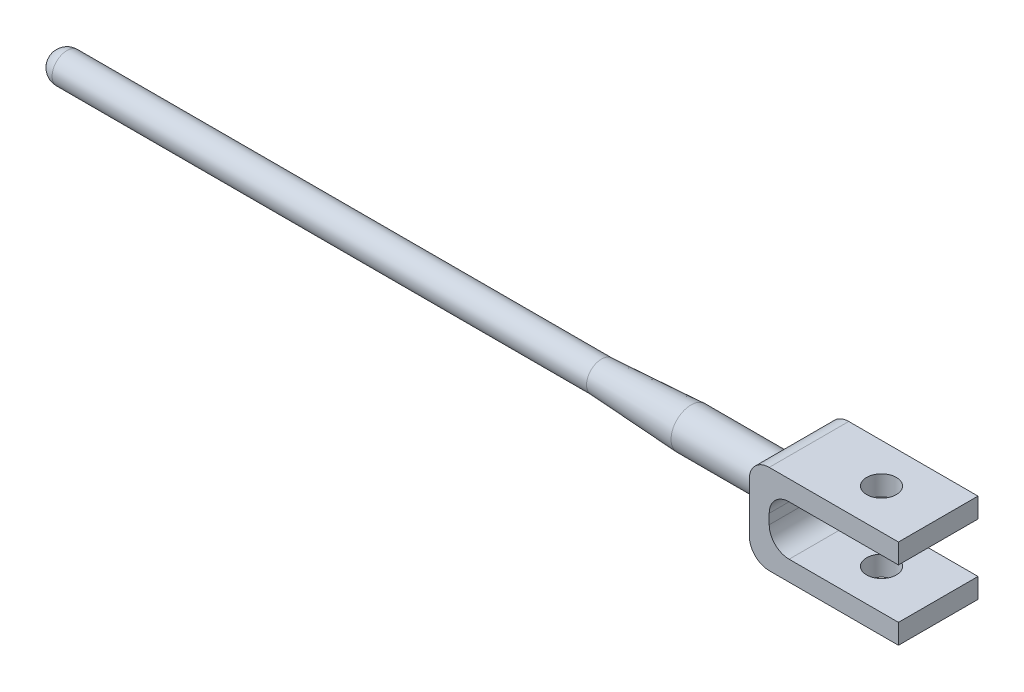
ISO-10303-21;
HEADER;
FILE_DESCRIPTION(('STEP AP214'),'2;1');
FILE_NAME('part.step','',(''),(''),'','','');
FILE_SCHEMA(('AUTOMOTIVE_DESIGN { 1 0 10303 214 1 1 1 1 }'));
ENDSEC;
DATA;
#1=APPLICATION_CONTEXT('core data for automotive mechanical design processes');
#2=APPLICATION_PROTOCOL_DEFINITION('international standard','automotive_design',2000,#1);
#3=PRODUCT_CONTEXT('',#1,'mechanical');
#4=PRODUCT('Part','Part','',(#3));
#5=PRODUCT_RELATED_PRODUCT_CATEGORY('part','',(#4));
#6=PRODUCT_DEFINITION_FORMATION('','',#4);
#7=PRODUCT_DEFINITION_CONTEXT('part definition',#1,'design');
#8=PRODUCT_DEFINITION('design','',#6,#7);
#9=PRODUCT_DEFINITION_SHAPE('','',#8);
#10=(LENGTH_UNIT() NAMED_UNIT(*) SI_UNIT(.MILLI.,.METRE.));
#11=(NAMED_UNIT(*) PLANE_ANGLE_UNIT() SI_UNIT($,.RADIAN.));
#12=(NAMED_UNIT(*) SI_UNIT($,.STERADIAN.) SOLID_ANGLE_UNIT());
#13=UNCERTAINTY_MEASURE_WITH_UNIT(LENGTH_MEASURE(1.E-05),#10,'distance_accuracy_value','');
#14=(GEOMETRIC_REPRESENTATION_CONTEXT(3) GLOBAL_UNCERTAINTY_ASSIGNED_CONTEXT((#13)) GLOBAL_UNIT_ASSIGNED_CONTEXT((#10,
#11,#12)) REPRESENTATION_CONTEXT('',''));
#15=CARTESIAN_POINT('',(0.,0.,0.));
#16=DIRECTION('',(0.,0.,1.));
#17=DIRECTION('',(1.,0.,0.));
#18=AXIS2_PLACEMENT_3D('',#15,#16,#17);
#19=CARTESIAN_POINT('',(-25.8599805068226,2.5,8.));
#20=DIRECTION('',(1.,0.,0.));
#21=DIRECTION('',(0.,0.,-1.));
#22=AXIS2_PLACEMENT_3D('',#19,#20,#21);
#23=PLANE('',#22);
#24=DIRECTION('',(0.,-1.,0.));
#25=VECTOR('',#24,1.);
#26=CARTESIAN_POINT('',(-25.8599805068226,2.5,0.));
#27=LINE('',#26,#25);
#28=CARTESIAN_POINT('',(-25.8599805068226,2.5,0.));
#29=VERTEX_POINT('',#28);
#30=CARTESIAN_POINT('',(-25.8599805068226,-2.5,0.));
#31=VERTEX_POINT('',#30);
#32=EDGE_CURVE('E161',#29,#31,#27,.T.);
#33=ORIENTED_EDGE('',*,*,#32,.T.);
#34=DIRECTION('',(0.,0.,-1.));
#35=VECTOR('',#34,1.);
#36=CARTESIAN_POINT('',(-25.8599805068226,-2.5,8.));
#37=LINE('',#36,#35);
#38=CARTESIAN_POINT('',(-25.8599805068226,-2.5,8.));
#39=VERTEX_POINT('',#38);
#40=EDGE_CURVE('E192',#39,#31,#37,.T.);
#41=ORIENTED_EDGE('',*,*,#40,.F.);
#42=DIRECTION('',(0.,-1.,0.));
#43=VECTOR('',#42,1.);
#44=CARTESIAN_POINT('',(-25.8599805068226,2.5,8.));
#45=LINE('',#44,#43);
#46=CARTESIAN_POINT('',(-25.8599805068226,2.5,8.));
#47=VERTEX_POINT('',#46);
#48=EDGE_CURVE('E223',#47,#39,#45,.T.);
#49=ORIENTED_EDGE('',*,*,#48,.F.);
#50=DIRECTION('',(0.,0.,-1.));
#51=VECTOR('',#50,1.);
#52=CARTESIAN_POINT('',(-25.8599805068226,2.5,8.));
#53=LINE('',#52,#51);
#54=EDGE_CURVE('E195',#47,#29,#53,.T.);
#55=ORIENTED_EDGE('',*,*,#54,.T.);
#56=EDGE_LOOP('',(#33,#41,#49,#55));
#57=FACE_BOUND('',#56,.T.);
#58=CARTESIAN_POINT('',(-25.8599805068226,0.,3.99950536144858));
#59=DIRECTION('',(1.,0.,0.));
#60=DIRECTION('',(0.,0.,-1.));
#61=AXIS2_PLACEMENT_3D('',#58,#59,#60);
#62=CIRCLE('',#61,1.99950536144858);
#63=CARTESIAN_POINT('',(-25.8599805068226,0.,2.));
#64=VERTEX_POINT('',#63);
#65=EDGE_CURVE('E11',#64,#64,#62,.F.);
#66=ORIENTED_EDGE('',*,*,#65,.F.);
#67=EDGE_LOOP('',(#66));
#68=FACE_BOUND('',#67,.T.);
#69=ADVANCED_FACE('F31',(#57,#68),#23,.F.);
#70=CARTESIAN_POINT('',(-10.8599805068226,2.5,8.));
#71=DIRECTION('',(-1.,0.,0.));
#72=DIRECTION('',(0.,-1.,0.));
#73=AXIS2_PLACEMENT_3D('',#70,#71,#72);
#74=PLANE('',#73);
#75=DIRECTION('',(0.,1.,0.));
#76=VECTOR('',#75,1.);
#77=CARTESIAN_POINT('',(-10.8599805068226,2.5,0.));
#78=LINE('',#77,#76);
#79=CARTESIAN_POINT('',(-10.8599805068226,2.5,0.));
#80=VERTEX_POINT('',#79);
#81=CARTESIAN_POINT('',(-10.8599805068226,4.5,0.));
#82=VERTEX_POINT('',#81);
#83=EDGE_CURVE('E153',#80,#82,#78,.T.);
#84=ORIENTED_EDGE('',*,*,#83,.T.);
#85=DIRECTION('',(0.,0.,-1.));
#86=VECTOR('',#85,1.);
#87=CARTESIAN_POINT('',(-10.8599805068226,4.5,8.));
#88=LINE('',#87,#86);
#89=CARTESIAN_POINT('',(-10.8599805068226,4.5,8.));
#90=VERTEX_POINT('',#89);
#91=EDGE_CURVE('E40',#90,#82,#88,.T.);
#92=ORIENTED_EDGE('',*,*,#91,.F.);
#93=DIRECTION('',(0.,1.,0.));
#94=VECTOR('',#93,1.);
#95=CARTESIAN_POINT('',(-10.8599805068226,2.5,8.));
#96=LINE('',#95,#94);
#97=CARTESIAN_POINT('',(-10.8599805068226,2.5,8.));
#98=VERTEX_POINT('',#97);
#99=EDGE_CURVE('E176',#98,#90,#96,.T.);
#100=ORIENTED_EDGE('',*,*,#99,.F.);
#101=DIRECTION('',(0.,0.,-1.));
#102=VECTOR('',#101,1.);
#103=CARTESIAN_POINT('',(-10.8599805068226,2.5,8.));
#104=LINE('',#103,#102);
#105=EDGE_CURVE('E149',#98,#80,#104,.T.);
#106=ORIENTED_EDGE('',*,*,#105,.T.);
#107=EDGE_LOOP('',(#84,#92,#100,#106));
#108=FACE_BOUND('',#107,.T.);
#109=ADVANCED_FACE('F33',(#108),#74,.F.);
#110=CARTESIAN_POINT('',(-10.8599805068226,4.5,8.));
#111=DIRECTION('',(0.,-1.,0.));
#112=DIRECTION('',(1.,0.,0.));
#113=AXIS2_PLACEMENT_3D('',#110,#111,#112);
#114=PLANE('',#113);
#115=CARTESIAN_POINT('',(-16.5925733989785,4.49999999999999,3.9745154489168));
#116=DIRECTION('',(0.,1.,0.));
#117=DIRECTION('',(-1.,0.,0.));
#118=AXIS2_PLACEMENT_3D('',#115,#116,#117);
#119=CIRCLE('',#118,1.5);
#120=CARTESIAN_POINT('',(-18.0925733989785,4.49999999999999,3.9745154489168));
#121=VERTEX_POINT('',#120);
#122=EDGE_CURVE('E209',#121,#121,#119,.T.);
#123=ORIENTED_EDGE('',*,*,#122,.F.);
#124=EDGE_LOOP('',(#123));
#125=FACE_BOUND('',#124,.T.);
#126=DIRECTION('',(-1.,0.,0.));
#127=VECTOR('',#126,1.);
#128=CARTESIAN_POINT('',(-10.8599805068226,4.5,0.));
#129=LINE('',#128,#127);
#130=CARTESIAN_POINT('',(-23.8599805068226,4.5,0.));
#131=VERTEX_POINT('',#130);
#132=EDGE_CURVE('E156',#82,#131,#129,.T.);
#133=ORIENTED_EDGE('',*,*,#132,.T.);
#134=DIRECTION('',(0.,0.,-1.));
#135=VECTOR('',#134,1.);
#136=CARTESIAN_POINT('',(-23.8599805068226,4.5,8.));
#137=LINE('',#136,#135);
#138=CARTESIAN_POINT('',(-23.8599805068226,4.5,8.));
#139=VERTEX_POINT('',#138);
#140=EDGE_CURVE('E198',#139,#131,#137,.T.);
#141=ORIENTED_EDGE('',*,*,#140,.F.);
#142=DIRECTION('',(-1.,0.,0.));
#143=VECTOR('',#142,1.);
#144=CARTESIAN_POINT('',(-10.8599805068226,4.5,8.));
#145=LINE('',#144,#143);
#146=EDGE_CURVE('E104',#90,#139,#145,.T.);
#147=ORIENTED_EDGE('',*,*,#146,.F.);
#148=ORIENTED_EDGE('',*,*,#91,.T.);
#149=EDGE_LOOP('',(#133,#141,#147,#148));
#150=FACE_BOUND('',#149,.T.);
#151=ADVANCED_FACE('F265',(#125,#150),#114,.F.);
#152=CARTESIAN_POINT('',(-23.8599805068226,2.5,8.));
#153=DIRECTION('',(0.,0.,-1.));
#154=DIRECTION('',(-1.,0.,0.));
#155=AXIS2_PLACEMENT_3D('',#152,#153,#154);
#156=CYLINDRICAL_SURFACE('',#155,2.);
#157=CARTESIAN_POINT('',(-23.8599805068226,2.5,0.));
#158=DIRECTION('',(0.,0.,1.));
#159=DIRECTION('',(-1.,0.,0.));
#160=AXIS2_PLACEMENT_3D('',#157,#158,#159);
#161=CIRCLE('',#160,2.);
#162=EDGE_CURVE('E159',#131,#29,#161,.T.);
#163=ORIENTED_EDGE('',*,*,#162,.T.);
#164=ORIENTED_EDGE('',*,*,#54,.F.);
#165=CARTESIAN_POINT('',(-23.8599805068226,2.5,8.));
#166=DIRECTION('',(0.,0.,1.));
#167=DIRECTION('',(-1.,0.,0.));
#168=AXIS2_PLACEMENT_3D('',#165,#166,#167);
#169=CIRCLE('',#168,2.);
#170=EDGE_CURVE('E221',#139,#47,#169,.T.);
#171=ORIENTED_EDGE('',*,*,#170,.F.);
#172=ORIENTED_EDGE('',*,*,#140,.T.);
#173=EDGE_LOOP('',(#163,#164,#171,#172));
#174=FACE_BOUND('',#173,.T.);
#175=ADVANCED_FACE('F271',(#174),#156,.T.);
#176=CARTESIAN_POINT('',(-23.8599805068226,-2.5,8.));
#177=DIRECTION('',(0.,0.,-1.));
#178=DIRECTION('',(-1.,0.,0.));
#179=AXIS2_PLACEMENT_3D('',#176,#177,#178);
#180=CYLINDRICAL_SURFACE('',#179,2.);
#181=CARTESIAN_POINT('',(-23.8599805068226,-2.5,0.));
#182=DIRECTION('',(0.,0.,1.));
#183=DIRECTION('',(-1.,0.,0.));
#184=AXIS2_PLACEMENT_3D('',#181,#182,#183);
#185=CIRCLE('',#184,2.);
#186=CARTESIAN_POINT('',(-23.8599805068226,-4.5,0.));
#187=VERTEX_POINT('',#186);
#188=EDGE_CURVE('E163',#31,#187,#185,.T.);
#189=ORIENTED_EDGE('',*,*,#188,.T.);
#190=DIRECTION('',(0.,0.,-1.));
#191=VECTOR('',#190,1.);
#192=CARTESIAN_POINT('',(-23.8599805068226,-4.5,8.));
#193=LINE('',#192,#191);
#194=CARTESIAN_POINT('',(-23.8599805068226,-4.5,8.));
#195=VERTEX_POINT('',#194);
#196=EDGE_CURVE('E189',#195,#187,#193,.T.);
#197=ORIENTED_EDGE('',*,*,#196,.F.);
#198=CARTESIAN_POINT('',(-23.8599805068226,-2.5,8.));
#199=DIRECTION('',(0.,0.,1.));
#200=DIRECTION('',(-1.,0.,0.));
#201=AXIS2_PLACEMENT_3D('',#198,#199,#200);
#202=CIRCLE('',#201,2.);
#203=EDGE_CURVE('E225',#39,#195,#202,.T.);
#204=ORIENTED_EDGE('',*,*,#203,.F.);
#205=ORIENTED_EDGE('',*,*,#40,.T.);
#206=EDGE_LOOP('',(#189,#197,#204,#205));
#207=FACE_BOUND('',#206,.T.);
#208=ADVANCED_FACE('F269',(#207),#180,.T.);
#209=CARTESIAN_POINT('',(-23.8599805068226,-4.5,8.));
#210=DIRECTION('',(0.,1.,0.));
#211=DIRECTION('',(-1.,0.,0.));
#212=AXIS2_PLACEMENT_3D('',#209,#210,#211);
#213=PLANE('',#212);
#214=CARTESIAN_POINT('',(-16.5925733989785,-4.5,3.9745154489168));
#215=DIRECTION('',(0.,1.,0.));
#216=DIRECTION('',(-1.,0.,0.));
#217=AXIS2_PLACEMENT_3D('',#214,#215,#216);
#218=CIRCLE('',#217,1.5);
#219=CARTESIAN_POINT('',(-18.0925733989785,-4.5,3.9745154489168));
#220=VERTEX_POINT('',#219);
#221=EDGE_CURVE('E203',#220,#220,#218,.T.);
#222=ORIENTED_EDGE('',*,*,#221,.T.);
#223=EDGE_LOOP('',(#222));
#224=FACE_BOUND('',#223,.T.);
#225=DIRECTION('',(1.,0.,0.));
#226=VECTOR('',#225,1.);
#227=CARTESIAN_POINT('',(-23.8599805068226,-4.5,0.));
#228=LINE('',#227,#226);
#229=CARTESIAN_POINT('',(-10.8599805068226,-4.5,0.));
#230=VERTEX_POINT('',#229);
#231=EDGE_CURVE('E165',#187,#230,#228,.T.);
#232=ORIENTED_EDGE('',*,*,#231,.T.);
#233=DIRECTION('',(0.,0.,-1.));
#234=VECTOR('',#233,1.);
#235=CARTESIAN_POINT('',(-10.8599805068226,-4.5,8.));
#236=LINE('',#235,#234);
#237=CARTESIAN_POINT('',(-10.8599805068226,-4.5,8.));
#238=VERTEX_POINT('',#237);
#239=EDGE_CURVE('E186',#238,#230,#236,.T.);
#240=ORIENTED_EDGE('',*,*,#239,.F.);
#241=DIRECTION('',(1.,0.,0.));
#242=VECTOR('',#241,1.);
#243=CARTESIAN_POINT('',(-23.8599805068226,-4.5,8.));
#244=LINE('',#243,#242);
#245=EDGE_CURVE('E227',#195,#238,#244,.T.);
#246=ORIENTED_EDGE('',*,*,#245,.F.);
#247=ORIENTED_EDGE('',*,*,#196,.T.);
#248=EDGE_LOOP('',(#232,#240,#246,#247));
#249=FACE_BOUND('',#248,.T.);
#250=ADVANCED_FACE('F292',(#224,#249),#213,.F.);
#251=CARTESIAN_POINT('',(-10.8599805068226,-4.5,8.));
#252=DIRECTION('',(-1.,0.,0.));
#253=DIRECTION('',(0.,0.,1.));
#254=AXIS2_PLACEMENT_3D('',#251,#252,#253);
#255=PLANE('',#254);
#256=DIRECTION('',(0.,1.,0.));
#257=VECTOR('',#256,1.);
#258=CARTESIAN_POINT('',(-10.8599805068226,-4.5,0.));
#259=LINE('',#258,#257);
#260=CARTESIAN_POINT('',(-10.8599805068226,-2.5,0.));
#261=VERTEX_POINT('',#260);
#262=EDGE_CURVE('E167',#230,#261,#259,.T.);
#263=ORIENTED_EDGE('',*,*,#262,.T.);
#264=DIRECTION('',(0.,0.,-1.));
#265=VECTOR('',#264,1.);
#266=CARTESIAN_POINT('',(-10.8599805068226,-2.5,8.));
#267=LINE('',#266,#265);
#268=CARTESIAN_POINT('',(-10.8599805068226,-2.5,8.));
#269=VERTEX_POINT('',#268);
#270=EDGE_CURVE('E183',#269,#261,#267,.T.);
#271=ORIENTED_EDGE('',*,*,#270,.F.);
#272=DIRECTION('',(0.,1.,0.));
#273=VECTOR('',#272,1.);
#274=CARTESIAN_POINT('',(-10.8599805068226,-4.5,8.));
#275=LINE('',#274,#273);
#276=EDGE_CURVE('E229',#238,#269,#275,.T.);
#277=ORIENTED_EDGE('',*,*,#276,.F.);
#278=ORIENTED_EDGE('',*,*,#239,.T.);
#279=EDGE_LOOP('',(#263,#271,#277,#278));
#280=FACE_BOUND('',#279,.T.);
#281=ADVANCED_FACE('F295',(#280),#255,.F.);
#282=CARTESIAN_POINT('',(-10.8599805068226,-2.5,8.));
#283=DIRECTION('',(0.,-1.,0.));
#284=DIRECTION('',(1.,0.,0.));
#285=AXIS2_PLACEMENT_3D('',#282,#283,#284);
#286=PLANE('',#285);
#287=CARTESIAN_POINT('',(-16.5925733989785,-2.5,3.9745154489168));
#288=DIRECTION('',(0.,-1.,0.));
#289=DIRECTION('',(1.,0.,0.));
#290=AXIS2_PLACEMENT_3D('',#287,#288,#289);
#291=CIRCLE('',#290,1.5);
#292=CARTESIAN_POINT('',(-15.0925733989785,-2.5,3.9745154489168));
#293=VERTEX_POINT('',#292);
#294=EDGE_CURVE('E157',#293,#293,#291,.T.);
#295=ORIENTED_EDGE('',*,*,#294,.T.);
#296=EDGE_LOOP('',(#295));
#297=FACE_BOUND('',#296,.T.);
#298=DIRECTION('',(-1.,0.,0.));
#299=VECTOR('',#298,1.);
#300=CARTESIAN_POINT('',(-10.8599805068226,-2.5,0.));
#301=LINE('',#300,#299);
#302=CARTESIAN_POINT('',(-21.8599805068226,-2.5,0.));
#303=VERTEX_POINT('',#302);
#304=EDGE_CURVE('E169',#261,#303,#301,.T.);
#305=ORIENTED_EDGE('',*,*,#304,.T.);
#306=DIRECTION('',(0.,0.,-1.));
#307=VECTOR('',#306,1.);
#308=CARTESIAN_POINT('',(-21.8599805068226,-2.5,8.));
#309=LINE('',#308,#307);
#310=CARTESIAN_POINT('',(-21.8599805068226,-2.5,8.));
#311=VERTEX_POINT('',#310);
#312=EDGE_CURVE('E180',#311,#303,#309,.T.);
#313=ORIENTED_EDGE('',*,*,#312,.F.);
#314=DIRECTION('',(-1.,0.,0.));
#315=VECTOR('',#314,1.);
#316=CARTESIAN_POINT('',(-10.8599805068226,-2.5,8.));
#317=LINE('',#316,#315);
#318=EDGE_CURVE('E231',#269,#311,#317,.T.);
#319=ORIENTED_EDGE('',*,*,#318,.F.);
#320=ORIENTED_EDGE('',*,*,#270,.T.);
#321=EDGE_LOOP('',(#305,#313,#319,#320));
#322=FACE_BOUND('',#321,.T.);
#323=ADVANCED_FACE('F237',(#297,#322),#286,.F.);
#324=CARTESIAN_POINT('',(-21.8599805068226,-0.500000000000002,8.));
#325=DIRECTION('',(0.,0.,-1.));
#326=DIRECTION('',(-1.,0.,0.));
#327=AXIS2_PLACEMENT_3D('',#324,#325,#326);
#328=CYLINDRICAL_SURFACE('',#327,2.);
#329=CARTESIAN_POINT('',(-21.8599805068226,-0.500000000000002,0.));
#330=DIRECTION('',(0.,0.,-1.));
#331=DIRECTION('',(-1.,0.,0.));
#332=AXIS2_PLACEMENT_3D('',#329,#330,#331);
#333=CIRCLE('',#332,2.);
#334=CARTESIAN_POINT('',(-23.8599805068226,-0.500000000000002,0.));
#335=VERTEX_POINT('',#334);
#336=EDGE_CURVE('E171',#303,#335,#333,.T.);
#337=ORIENTED_EDGE('',*,*,#336,.T.);
#338=DIRECTION('',(0.,0.,-1.));
#339=VECTOR('',#338,1.);
#340=CARTESIAN_POINT('',(-23.8599805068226,-0.500000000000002,8.));
#341=LINE('',#340,#339);
#342=CARTESIAN_POINT('',(-23.8599805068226,-0.500000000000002,8.));
#343=VERTEX_POINT('',#342);
#344=EDGE_CURVE('E144',#343,#335,#341,.T.);
#345=ORIENTED_EDGE('',*,*,#344,.F.);
#346=CARTESIAN_POINT('',(-21.8599805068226,-0.500000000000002,8.));
#347=DIRECTION('',(0.,0.,-1.));
#348=DIRECTION('',(-1.,0.,0.));
#349=AXIS2_PLACEMENT_3D('',#346,#347,#348);
#350=CIRCLE('',#349,2.);
#351=EDGE_CURVE('E135',#311,#343,#350,.T.);
#352=ORIENTED_EDGE('',*,*,#351,.F.);
#353=ORIENTED_EDGE('',*,*,#312,.T.);
#354=EDGE_LOOP('',(#337,#345,#352,#353));
#355=FACE_BOUND('',#354,.T.);
#356=ADVANCED_FACE('F241',(#355),#328,.F.);
#357=CARTESIAN_POINT('',(-23.8599805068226,-0.500000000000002,8.));
#358=DIRECTION('',(-1.,0.,0.));
#359=DIRECTION('',(0.,0.,1.));
#360=AXIS2_PLACEMENT_3D('',#357,#358,#359);
#361=PLANE('',#360);
#362=DIRECTION('',(0.,1.,0.));
#363=VECTOR('',#362,1.);
#364=CARTESIAN_POINT('',(-23.8599805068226,-0.500000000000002,0.));
#365=LINE('',#364,#363);
#366=CARTESIAN_POINT('',(-23.8599805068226,0.499999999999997,0.));
#367=VERTEX_POINT('',#366);
#368=EDGE_CURVE('E143',#335,#367,#365,.T.);
#369=ORIENTED_EDGE('',*,*,#368,.T.);
#370=DIRECTION('',(0.,0.,-1.));
#371=VECTOR('',#370,1.);
#372=CARTESIAN_POINT('',(-23.8599805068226,0.499999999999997,8.));
#373=LINE('',#372,#371);
#374=CARTESIAN_POINT('',(-23.8599805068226,0.499999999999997,8.));
#375=VERTEX_POINT('',#374);
#376=EDGE_CURVE('E140',#375,#367,#373,.T.);
#377=ORIENTED_EDGE('',*,*,#376,.F.);
#378=DIRECTION('',(0.,1.,0.));
#379=VECTOR('',#378,1.);
#380=CARTESIAN_POINT('',(-23.8599805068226,-0.500000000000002,8.));
#381=LINE('',#380,#379);
#382=EDGE_CURVE('E129',#343,#375,#381,.T.);
#383=ORIENTED_EDGE('',*,*,#382,.F.);
#384=ORIENTED_EDGE('',*,*,#344,.T.);
#385=EDGE_LOOP('',(#369,#377,#383,#384));
#386=FACE_BOUND('',#385,.T.);
#387=ADVANCED_FACE('F141',(#386),#361,.F.);
#388=CARTESIAN_POINT('',(-21.8599805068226,0.499999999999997,8.));
#389=DIRECTION('',(0.,0.,-1.));
#390=DIRECTION('',(-1.,0.,0.));
#391=AXIS2_PLACEMENT_3D('',#388,#389,#390);
#392=CYLINDRICAL_SURFACE('',#391,2.);
#393=CARTESIAN_POINT('',(-21.8599805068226,0.499999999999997,0.));
#394=DIRECTION('',(0.,0.,-1.));
#395=DIRECTION('',(-1.,0.,0.));
#396=AXIS2_PLACEMENT_3D('',#393,#394,#395);
#397=CIRCLE('',#396,2.);
#398=CARTESIAN_POINT('',(-21.8599805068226,2.5,0.));
#399=VERTEX_POINT('',#398);
#400=EDGE_CURVE('E89',#367,#399,#397,.T.);
#401=ORIENTED_EDGE('',*,*,#400,.T.);
#402=DIRECTION('',(0.,0.,-1.));
#403=VECTOR('',#402,1.);
#404=CARTESIAN_POINT('',(-21.8599805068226,2.5,8.));
#405=LINE('',#404,#403);
#406=CARTESIAN_POINT('',(-21.8599805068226,2.5,8.));
#407=VERTEX_POINT('',#406);
#408=EDGE_CURVE('E145',#407,#399,#405,.T.);
#409=ORIENTED_EDGE('',*,*,#408,.F.);
#410=CARTESIAN_POINT('',(-21.8599805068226,0.499999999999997,8.));
#411=DIRECTION('',(0.,0.,-1.));
#412=DIRECTION('',(-1.,0.,0.));
#413=AXIS2_PLACEMENT_3D('',#410,#411,#412);
#414=CIRCLE('',#413,2.);
#415=EDGE_CURVE('E133',#375,#407,#414,.T.);
#416=ORIENTED_EDGE('',*,*,#415,.F.);
#417=ORIENTED_EDGE('',*,*,#376,.T.);
#418=EDGE_LOOP('',(#401,#409,#416,#417));
#419=FACE_BOUND('',#418,.T.);
#420=ADVANCED_FACE('F147',(#419),#392,.F.);
#421=CARTESIAN_POINT('',(-21.8599805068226,2.5,8.));
#422=DIRECTION('',(0.,1.,0.));
#423=DIRECTION('',(0.,0.,1.));
#424=AXIS2_PLACEMENT_3D('',#421,#422,#423);
#425=PLANE('',#424);
#426=CARTESIAN_POINT('',(-16.5925733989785,2.5,3.9745154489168));
#427=DIRECTION('',(0.,1.,0.));
#428=DIRECTION('',(0.,0.,1.));
#429=AXIS2_PLACEMENT_3D('',#426,#427,#428);
#430=CIRCLE('',#429,1.5);
#431=CARTESIAN_POINT('',(-16.5925733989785,2.5,5.47451544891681));
#432=VERTEX_POINT('',#431);
#433=EDGE_CURVE('E201',#432,#432,#430,.T.);
#434=ORIENTED_EDGE('',*,*,#433,.T.);
#435=EDGE_LOOP('',(#434));
#436=FACE_BOUND('',#435,.T.);
#437=DIRECTION('',(1.,0.,0.));
#438=VECTOR('',#437,1.);
#439=CARTESIAN_POINT('',(-21.8599805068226,2.5,0.));
#440=LINE('',#439,#438);
#441=EDGE_CURVE('E95',#399,#80,#440,.T.);
#442=ORIENTED_EDGE('',*,*,#441,.T.);
#443=ORIENTED_EDGE('',*,*,#105,.F.);
#444=DIRECTION('',(1.,0.,0.));
#445=VECTOR('',#444,1.);
#446=CARTESIAN_POINT('',(-21.8599805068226,2.5,8.));
#447=LINE('',#446,#445);
#448=EDGE_CURVE('E48',#407,#98,#447,.T.);
#449=ORIENTED_EDGE('',*,*,#448,.F.);
#450=ORIENTED_EDGE('',*,*,#408,.T.);
#451=EDGE_LOOP('',(#442,#443,#449,#450));
#452=FACE_BOUND('',#451,.T.);
#453=ADVANCED_FACE('F249',(#436,#452),#425,.F.);
#454=CARTESIAN_POINT('',(-23.8599805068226,2.5,8.));
#455=DIRECTION('',(0.,0.,-1.));
#456=DIRECTION('',(-1.,0.,0.));
#457=AXIS2_PLACEMENT_3D('',#454,#455,#456);
#458=PLANE('',#457);
#459=ORIENTED_EDGE('',*,*,#99,.T.);
#460=ORIENTED_EDGE('',*,*,#146,.T.);
#461=ORIENTED_EDGE('',*,*,#170,.T.);
#462=ORIENTED_EDGE('',*,*,#48,.T.);
#463=ORIENTED_EDGE('',*,*,#203,.T.);
#464=ORIENTED_EDGE('',*,*,#245,.T.);
#465=ORIENTED_EDGE('',*,*,#276,.T.);
#466=ORIENTED_EDGE('',*,*,#318,.T.);
#467=ORIENTED_EDGE('',*,*,#351,.T.);
#468=ORIENTED_EDGE('',*,*,#382,.T.);
#469=ORIENTED_EDGE('',*,*,#415,.T.);
#470=ORIENTED_EDGE('',*,*,#448,.T.);
#471=EDGE_LOOP('',(#459,#460,#461,#462,#463,#464,#465,#466,#467,#468,#469,#470));
#472=FACE_BOUND('',#471,.T.);
#473=ADVANCED_FACE('F131',(#472),#458,.F.);
#474=CARTESIAN_POINT('',(-23.8599805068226,2.5,0.));
#475=DIRECTION('',(0.,0.,-1.));
#476=DIRECTION('',(-1.,0.,0.));
#477=AXIS2_PLACEMENT_3D('',#474,#475,#476);
#478=PLANE('',#477);
#479=ORIENTED_EDGE('',*,*,#83,.F.);
#480=ORIENTED_EDGE('',*,*,#441,.F.);
#481=ORIENTED_EDGE('',*,*,#400,.F.);
#482=ORIENTED_EDGE('',*,*,#368,.F.);
#483=ORIENTED_EDGE('',*,*,#336,.F.);
#484=ORIENTED_EDGE('',*,*,#304,.F.);
#485=ORIENTED_EDGE('',*,*,#262,.F.);
#486=ORIENTED_EDGE('',*,*,#231,.F.);
#487=ORIENTED_EDGE('',*,*,#188,.F.);
#488=ORIENTED_EDGE('',*,*,#32,.F.);
#489=ORIENTED_EDGE('',*,*,#162,.F.);
#490=ORIENTED_EDGE('',*,*,#132,.F.);
#491=EDGE_LOOP('',(#479,#480,#481,#482,#483,#484,#485,#486,#487,#488,#489,#490));
#492=FACE_BOUND('',#491,.T.);
#493=ADVANCED_FACE('F244',(#492),#478,.T.);
#494=CARTESIAN_POINT('',(-16.5925733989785,-4.5,3.9745154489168));
#495=DIRECTION('',(0.,1.,0.));
#496=DIRECTION('',(-1.,0.,0.));
#497=AXIS2_PLACEMENT_3D('',#494,#495,#496);
#498=CYLINDRICAL_SURFACE('',#497,1.5);
#499=ORIENTED_EDGE('',*,*,#122,.T.);
#500=EDGE_LOOP('',(#499));
#501=FACE_BOUND('',#500,.T.);
#502=ORIENTED_EDGE('',*,*,#433,.F.);
#503=EDGE_LOOP('',(#502));
#504=FACE_BOUND('',#503,.T.);
#505=ADVANCED_FACE('F331',(#501,#504),#498,.F.);
#506=ORIENTED_EDGE('',*,*,#221,.F.);
#507=EDGE_LOOP('',(#506));
#508=FACE_BOUND('',#507,.T.);
#509=ORIENTED_EDGE('',*,*,#294,.F.);
#510=EDGE_LOOP('',(#509));
#511=FACE_BOUND('',#510,.T.);
#512=ADVANCED_FACE('F365',(#508,#511),#498,.F.);
#513=CARTESIAN_POINT('',(-99.9899805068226,0.,3.99950536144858));
#514=DIRECTION('',(-1.,0.,0.));
#515=DIRECTION('',(0.,0.,1.));
#516=AXIS2_PLACEMENT_3D('',#513,#514,#515);
#517=CYLINDRICAL_SURFACE('',#516,1.99950536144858);
#518=CARTESIAN_POINT('',(-35.7325814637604,0.,3.99950536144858));
#519=DIRECTION('',(-1.,0.,0.));
#520=DIRECTION('',(0.,0.,1.));
#521=AXIS2_PLACEMENT_3D('',#518,#519,#520);
#522=CIRCLE('',#521,1.99950536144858);
#523=CARTESIAN_POINT('',(-35.7325814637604,0.,5.99901072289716));
#524=VERTEX_POINT('',#523);
#525=EDGE_CURVE('E214',#524,#524,#522,.T.);
#526=ORIENTED_EDGE('',*,*,#525,.F.);
#527=EDGE_LOOP('',(#526));
#528=FACE_BOUND('',#527,.T.);
#529=ORIENTED_EDGE('',*,*,#65,.T.);
#530=EDGE_LOOP('',(#529));
#531=FACE_BOUND('',#530,.T.);
#532=ADVANCED_FACE('F374',(#528,#531),#517,.T.);
#533=CARTESIAN_POINT('',(-35.7325814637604,0.,3.99950536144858));
#534=DIRECTION('',(1.,0.,0.));
#535=DIRECTION('',(0.,0.,-1.));
#536=AXIS2_PLACEMENT_3D('',#533,#534,#535);
#537=CONICAL_SURFACE('',#536,1.99950536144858,0.0554437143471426);
#538=CARTESIAN_POINT('',(-44.7325814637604,0.,3.99950536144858));
#539=DIRECTION('',(-1.,0.,0.));
#540=DIRECTION('',(0.,0.,1.));
#541=AXIS2_PLACEMENT_3D('',#538,#539,#540);
#542=CIRCLE('',#541,1.5);
#543=CARTESIAN_POINT('',(-44.7325814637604,0.,5.49950536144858));
#544=VERTEX_POINT('',#543);
#545=EDGE_CURVE('E425',#544,#544,#542,.T.);
#546=ORIENTED_EDGE('',*,*,#545,.F.);
#547=EDGE_LOOP('',(#546));
#548=FACE_BOUND('',#547,.T.);
#549=ORIENTED_EDGE('',*,*,#525,.T.);
#550=EDGE_LOOP('',(#549));
#551=FACE_BOUND('',#550,.T.);
#552=ADVANCED_FACE('F388',(#548,#551),#537,.T.);
#553=CARTESIAN_POINT('',(-99.9899805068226,0.,3.99950536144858));
#554=DIRECTION('',(-1.,0.,0.));
#555=DIRECTION('',(0.,0.,1.));
#556=AXIS2_PLACEMENT_3D('',#553,#554,#555);
#557=CYLINDRICAL_SURFACE('',#556,1.5);
#558=CARTESIAN_POINT('',(-98.4899805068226,0.,3.99950536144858));
#559=DIRECTION('',(-1.,0.,0.));
#560=DIRECTION('',(0.,0.,1.));
#561=AXIS2_PLACEMENT_3D('',#558,#559,#560);
#562=CIRCLE('',#561,1.49999999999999);
#563=CARTESIAN_POINT('',(-98.4899805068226,0.,5.49950536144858));
#564=VERTEX_POINT('',#563);
#565=EDGE_CURVE('E424',#564,#564,#562,.T.);
#566=ORIENTED_EDGE('',*,*,#565,.F.);
#567=EDGE_LOOP('',(#566));
#568=FACE_BOUND('',#567,.T.);
#569=ORIENTED_EDGE('',*,*,#545,.T.);
#570=EDGE_LOOP('',(#569));
#571=FACE_BOUND('',#570,.T.);
#572=ADVANCED_FACE('F398',(#568,#571),#557,.T.);
#573=CARTESIAN_POINT('',(-98.4899805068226,0.,3.99950536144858));
#574=DIRECTION('',(-1.,0.,0.));
#575=DIRECTION('',(0.,0.,-1.));
#576=AXIS2_PLACEMENT_3D('',#573,#574,#575);
#577=SPHERICAL_SURFACE('',#576,1.49999999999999);
#578=ORIENTED_EDGE('',*,*,#565,.T.);
#579=EDGE_LOOP('',(#578));
#580=FACE_BOUND('',#579,.T.);
#581=ADVANCED_FACE('F408',(#580),#577,.T.);
#582=CLOSED_SHELL('',(#69,#109,#151,#175,#208,#250,#281,#323,#356,#387,#420,#453,#473,#493,#505,
#512,#532,#552,#572,#581));
#583=MANIFOLD_SOLID_BREP('B2',#582);
#584=ADVANCED_BREP_SHAPE_REPRESENTATION('',(#18,#583),#14);
#585=SHAPE_DEFINITION_REPRESENTATION(#9,#584);
ENDSEC;
END-ISO-10303-21;
